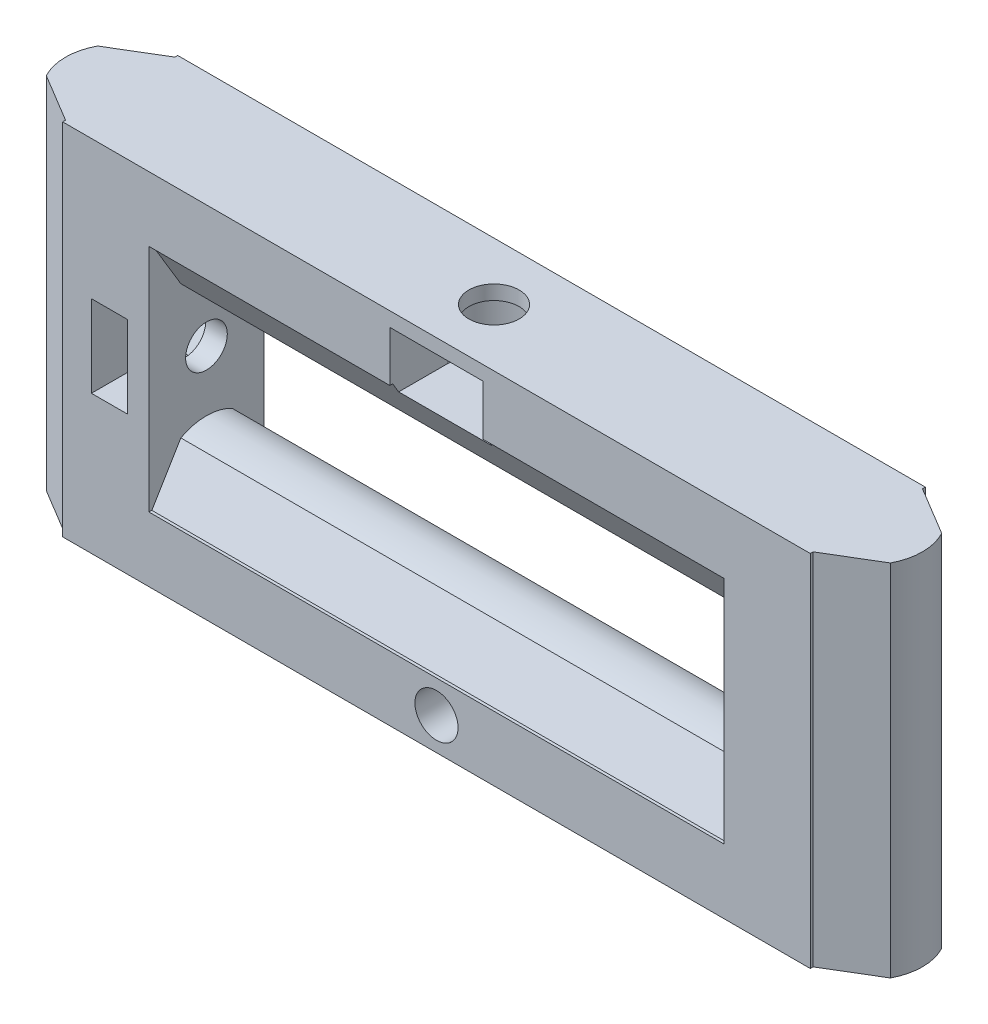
ISO-10303-21;
HEADER;
FILE_DESCRIPTION(('STEP AP214'),'2;1');
FILE_NAME('part.step','',(''),(''),'','','');
FILE_SCHEMA(('AUTOMOTIVE_DESIGN { 1 0 10303 214 1 1 1 1 }'));
ENDSEC;
DATA;
#1=APPLICATION_CONTEXT('core data for automotive mechanical design processes');
#2=APPLICATION_PROTOCOL_DEFINITION('international standard','automotive_design',2000,#1);
#3=PRODUCT_CONTEXT('',#1,'mechanical');
#4=PRODUCT('Part','Part','',(#3));
#5=PRODUCT_RELATED_PRODUCT_CATEGORY('part','',(#4));
#6=PRODUCT_DEFINITION_FORMATION('','',#4);
#7=PRODUCT_DEFINITION_CONTEXT('part definition',#1,'design');
#8=PRODUCT_DEFINITION('design','',#6,#7);
#9=PRODUCT_DEFINITION_SHAPE('','',#8);
#10=(LENGTH_UNIT() NAMED_UNIT(*) SI_UNIT(.MILLI.,.METRE.));
#11=(NAMED_UNIT(*) PLANE_ANGLE_UNIT() SI_UNIT($,.RADIAN.));
#12=(NAMED_UNIT(*) SI_UNIT($,.STERADIAN.) SOLID_ANGLE_UNIT());
#13=UNCERTAINTY_MEASURE_WITH_UNIT(LENGTH_MEASURE(1.E-05),#10,'distance_accuracy_value','');
#14=(GEOMETRIC_REPRESENTATION_CONTEXT(3) GLOBAL_UNCERTAINTY_ASSIGNED_CONTEXT((#13)) GLOBAL_UNIT_ASSIGNED_CONTEXT((#10,
#11,#12)) REPRESENTATION_CONTEXT('',''));
#15=CARTESIAN_POINT('',(0.,0.,0.));
#16=DIRECTION('',(0.,0.,1.));
#17=DIRECTION('',(1.,0.,0.));
#18=AXIS2_PLACEMENT_3D('',#15,#16,#17);
#19=CARTESIAN_POINT('',(-20.,20.5,0.));
#20=DIRECTION('',(0.,1.,0.));
#21=DIRECTION('',(0.,0.,1.));
#22=AXIS2_PLACEMENT_3D('',#19,#20,#21);
#23=PLANE('',#22);
#24=DIRECTION('',(0.,0.,-1.));
#25=VECTOR('',#24,1.);
#26=CARTESIAN_POINT('',(-3.25,20.5,0.));
#27=LINE('',#26,#25);
#28=CARTESIAN_POINT('',(-3.25,20.5,4.));
#29=VERTEX_POINT('',#28);
#30=CARTESIAN_POINT('',(-3.25,20.5,3.79999999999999));
#31=VERTEX_POINT('',#30);
#32=EDGE_CURVE('E315',#29,#31,#27,.T.);
#33=ORIENTED_EDGE('',*,*,#32,.F.);
#34=DIRECTION('',(1.,0.,0.));
#35=VECTOR('',#34,1.);
#36=CARTESIAN_POINT('',(0.,20.5,4.));
#37=LINE('',#36,#35);
#38=CARTESIAN_POINT('',(-20.,20.5,4.));
#39=VERTEX_POINT('',#38);
#40=EDGE_CURVE('E509',#39,#29,#37,.T.);
#41=ORIENTED_EDGE('',*,*,#40,.F.);
#42=DIRECTION('',(0.,0.,1.));
#43=VECTOR('',#42,1.);
#44=CARTESIAN_POINT('',(-20.,20.5,0.));
#45=LINE('',#44,#43);
#46=CARTESIAN_POINT('',(-20.,20.5,3.79999999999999));
#47=VERTEX_POINT('',#46);
#48=EDGE_CURVE('E1210',#47,#39,#45,.T.);
#49=ORIENTED_EDGE('',*,*,#48,.F.);
#50=DIRECTION('',(1.,0.,0.));
#51=VECTOR('',#50,1.);
#52=CARTESIAN_POINT('',(-20.,20.5,3.79999999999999));
#53=LINE('',#52,#51);
#54=EDGE_CURVE('E511',#47,#31,#53,.T.);
#55=ORIENTED_EDGE('',*,*,#54,.T.);
#56=EDGE_LOOP('',(#33,#41,#49,#55));
#57=FACE_BOUND('',#56,.T.);
#58=ADVANCED_FACE('F42',(#57),#23,.F.);
#59=CARTESIAN_POINT('',(0.,0.,4.));
#60=DIRECTION('',(0.,0.,-1.));
#61=DIRECTION('',(-1.,0.,0.));
#62=AXIS2_PLACEMENT_3D('',#59,#60,#61);
#63=PLANE('',#62);
#64=CARTESIAN_POINT('',(0.,2.25,4.));
#65=DIRECTION('',(0.,0.,1.));
#66=DIRECTION('',(1.,0.,0.));
#67=AXIS2_PLACEMENT_3D('',#64,#65,#66);
#68=CIRCLE('',#67,1.5);
#69=CARTESIAN_POINT('',(1.5,2.25,4.));
#70=VERTEX_POINT('',#69);
#71=EDGE_CURVE('E1197',#70,#70,#68,.T.);
#72=ORIENTED_EDGE('',*,*,#71,.F.);
#73=EDGE_LOOP('',(#72));
#74=FACE_BOUND('',#73,.T.);
#75=DIRECTION('',(1.,0.,0.));
#76=VECTOR('',#75,1.);
#77=CARTESIAN_POINT('',(0.,24.,4.));
#78=LINE('',#77,#76);
#79=CARTESIAN_POINT('',(-3.25,24.,4.));
#80=VERTEX_POINT('',#79);
#81=CARTESIAN_POINT('',(3.25,24.,4.));
#82=VERTEX_POINT('',#81);
#83=EDGE_CURVE('E296',#80,#82,#78,.T.);
#84=ORIENTED_EDGE('',*,*,#83,.T.);
#85=DIRECTION('',(0.,1.,0.));
#86=VECTOR('',#85,1.);
#87=CARTESIAN_POINT('',(3.25,19.8,4.));
#88=LINE('',#87,#86);
#89=CARTESIAN_POINT('',(3.25,20.5,4.));
#90=VERTEX_POINT('',#89);
#91=EDGE_CURVE('E316',#90,#82,#88,.T.);
#92=ORIENTED_EDGE('',*,*,#91,.F.);
#93=CARTESIAN_POINT('',(20.,20.5,4.));
#94=VERTEX_POINT('',#93);
#95=EDGE_CURVE('E519',#90,#94,#37,.T.);
#96=ORIENTED_EDGE('',*,*,#95,.T.);
#97=DIRECTION('',(0.,-1.,0.));
#98=VECTOR('',#97,1.);
#99=CARTESIAN_POINT('',(20.,0.,4.));
#100=LINE('',#99,#98);
#101=CARTESIAN_POINT('',(20.,4.5,4.));
#102=VERTEX_POINT('',#101);
#103=EDGE_CURVE('E593',#94,#102,#100,.T.);
#104=ORIENTED_EDGE('',*,*,#103,.T.);
#105=DIRECTION('',(1.,0.,0.));
#106=VECTOR('',#105,1.);
#107=CARTESIAN_POINT('',(0.,4.5,4.));
#108=LINE('',#107,#106);
#109=CARTESIAN_POINT('',(-20.,4.5,4.));
#110=VERTEX_POINT('',#109);
#111=EDGE_CURVE('E518',#110,#102,#108,.T.);
#112=ORIENTED_EDGE('',*,*,#111,.F.);
#113=DIRECTION('',(0.,-1.,0.));
#114=VECTOR('',#113,1.);
#115=CARTESIAN_POINT('',(-20.,0.,4.));
#116=LINE('',#115,#114);
#117=EDGE_CURVE('E516',#39,#110,#116,.T.);
#118=ORIENTED_EDGE('',*,*,#117,.F.);
#119=ORIENTED_EDGE('',*,*,#40,.T.);
#120=DIRECTION('',(0.,1.,0.));
#121=VECTOR('',#120,1.);
#122=CARTESIAN_POINT('',(-3.25,19.8,4.));
#123=LINE('',#122,#121);
#124=EDGE_CURVE('E286',#29,#80,#123,.T.);
#125=ORIENTED_EDGE('',*,*,#124,.T.);
#126=EDGE_LOOP('',(#84,#92,#96,#104,#112,#118,#119,#125));
#127=FACE_BOUND('',#126,.T.);
#128=DIRECTION('',(0.,-1.,0.));
#129=VECTOR('',#128,1.);
#130=CARTESIAN_POINT('',(-26.,25.,4.));
#131=LINE('',#130,#129);
#132=CARTESIAN_POINT('',(-26.,25.,4.));
#133=VERTEX_POINT('',#132);
#134=CARTESIAN_POINT('',(-26.,0.,4.));
#135=VERTEX_POINT('',#134);
#136=EDGE_CURVE('E619',#133,#135,#131,.T.);
#137=ORIENTED_EDGE('',*,*,#136,.T.);
#138=DIRECTION('',(1.,0.,0.));
#139=VECTOR('',#138,1.);
#140=CARTESIAN_POINT('',(26.,0.,4.));
#141=LINE('',#140,#139);
#142=CARTESIAN_POINT('',(26.,0.,4.));
#143=VERTEX_POINT('',#142);
#144=EDGE_CURVE('E623',#135,#143,#141,.T.);
#145=ORIENTED_EDGE('',*,*,#144,.T.);
#146=DIRECTION('',(0.,1.,0.));
#147=VECTOR('',#146,1.);
#148=CARTESIAN_POINT('',(26.,25.,4.));
#149=LINE('',#148,#147);
#150=CARTESIAN_POINT('',(26.,25.,4.));
#151=VERTEX_POINT('',#150);
#152=EDGE_CURVE('E627',#143,#151,#149,.T.);
#153=ORIENTED_EDGE('',*,*,#152,.T.);
#154=DIRECTION('',(-1.,0.,0.));
#155=VECTOR('',#154,1.);
#156=CARTESIAN_POINT('',(26.,25.,4.));
#157=LINE('',#156,#155);
#158=EDGE_CURVE('E630',#151,#133,#157,.T.);
#159=ORIENTED_EDGE('',*,*,#158,.T.);
#160=EDGE_LOOP('',(#137,#145,#153,#159));
#161=FACE_BOUND('',#160,.T.);
#162=DIRECTION('',(0.,1.,0.));
#163=VECTOR('',#162,1.);
#164=CARTESIAN_POINT('',(-21.5,0.,4.));
#165=LINE('',#164,#163);
#166=CARTESIAN_POINT('',(-21.5,9.65,4.));
#167=VERTEX_POINT('',#166);
#168=CARTESIAN_POINT('',(-21.5,15.35,4.));
#169=VERTEX_POINT('',#168);
#170=EDGE_CURVE('E338',#167,#169,#165,.T.);
#171=ORIENTED_EDGE('',*,*,#170,.F.);
#172=DIRECTION('',(-1.,0.,0.));
#173=VECTOR('',#172,1.);
#174=CARTESIAN_POINT('',(-21.5,9.65,4.));
#175=LINE('',#174,#173);
#176=CARTESIAN_POINT('',(-24.,9.65,4.));
#177=VERTEX_POINT('',#176);
#178=EDGE_CURVE('E354',#167,#177,#175,.T.);
#179=ORIENTED_EDGE('',*,*,#178,.T.);
#180=DIRECTION('',(0.,1.,0.));
#181=VECTOR('',#180,1.);
#182=CARTESIAN_POINT('',(-24.,0.,4.));
#183=LINE('',#182,#181);
#184=CARTESIAN_POINT('',(-24.,15.35,4.));
#185=VERTEX_POINT('',#184);
#186=EDGE_CURVE('E362',#177,#185,#183,.T.);
#187=ORIENTED_EDGE('',*,*,#186,.T.);
#188=DIRECTION('',(-1.,0.,0.));
#189=VECTOR('',#188,1.);
#190=CARTESIAN_POINT('',(-21.5,15.35,4.));
#191=LINE('',#190,#189);
#192=EDGE_CURVE('E385',#169,#185,#191,.T.);
#193=ORIENTED_EDGE('',*,*,#192,.F.);
#194=EDGE_LOOP('',(#171,#179,#187,#193));
#195=FACE_BOUND('',#194,.T.);
#196=ADVANCED_FACE('F468',(#74,#127,#161,#195),#63,.F.);
#197=CARTESIAN_POINT('',(-29.8,12.5,0.));
#198=DIRECTION('',(1.,0.,0.));
#199=DIRECTION('',(0.,0.,-1.));
#200=AXIS2_PLACEMENT_3D('',#197,#198,#199);
#201=CYLINDRICAL_SURFACE('',#200,1.45);
#202=CARTESIAN_POINT('',(-20.,12.5,0.));
#203=DIRECTION('',(1.,0.,0.));
#204=DIRECTION('',(0.,0.,-1.));
#205=AXIS2_PLACEMENT_3D('',#202,#203,#204);
#206=CIRCLE('',#205,1.45);
#207=CARTESIAN_POINT('',(-20.,12.5,-1.45));
#208=VERTEX_POINT('',#207);
#209=EDGE_CURVE('E378',#208,#208,#206,.T.);
#210=ORIENTED_EDGE('',*,*,#209,.T.);
#211=EDGE_LOOP('',(#210));
#212=FACE_BOUND('',#211,.T.);
#213=CARTESIAN_POINT('',(-21.5,12.5,0.));
#214=DIRECTION('',(-1.,0.,0.));
#215=DIRECTION('',(0.,0.,1.));
#216=AXIS2_PLACEMENT_3D('',#213,#214,#215);
#217=CIRCLE('',#216,1.45);
#218=CARTESIAN_POINT('',(-21.5,12.5,1.45));
#219=VERTEX_POINT('',#218);
#220=EDGE_CURVE('E329',#219,#219,#217,.T.);
#221=ORIENTED_EDGE('',*,*,#220,.T.);
#222=EDGE_LOOP('',(#221));
#223=FACE_BOUND('',#222,.T.);
#224=ADVANCED_FACE('F418',(#212,#223),#201,.F.);
#225=CARTESIAN_POINT('',(0.,0.,-4.));
#226=DIRECTION('',(0.,0.,-1.));
#227=DIRECTION('',(-1.,0.,0.));
#228=AXIS2_PLACEMENT_3D('',#225,#226,#227);
#229=PLANE('',#228);
#230=CARTESIAN_POINT('',(0.,2.25,-4.));
#231=DIRECTION('',(0.,0.,1.));
#232=DIRECTION('',(1.,0.,0.));
#233=AXIS2_PLACEMENT_3D('',#230,#231,#232);
#234=CIRCLE('',#233,1.5);
#235=CARTESIAN_POINT('',(1.5,2.25,-4.));
#236=VERTEX_POINT('',#235);
#237=EDGE_CURVE('E1194',#236,#236,#234,.T.);
#238=ORIENTED_EDGE('',*,*,#237,.T.);
#239=EDGE_LOOP('',(#238));
#240=FACE_BOUND('',#239,.T.);
#241=DIRECTION('',(0.,-1.,0.));
#242=VECTOR('',#241,1.);
#243=CARTESIAN_POINT('',(-26.,25.,-4.));
#244=LINE('',#243,#242);
#245=CARTESIAN_POINT('',(-26.,25.,-4.));
#246=VERTEX_POINT('',#245);
#247=CARTESIAN_POINT('',(-26.,0.,-4.));
#248=VERTEX_POINT('',#247);
#249=EDGE_CURVE('E618',#246,#248,#244,.T.);
#250=ORIENTED_EDGE('',*,*,#249,.F.);
#251=DIRECTION('',(-1.,0.,0.));
#252=VECTOR('',#251,1.);
#253=CARTESIAN_POINT('',(26.,25.,-4.));
#254=LINE('',#253,#252);
#255=CARTESIAN_POINT('',(26.,25.,-4.));
#256=VERTEX_POINT('',#255);
#257=EDGE_CURVE('E624',#256,#246,#254,.T.);
#258=ORIENTED_EDGE('',*,*,#257,.F.);
#259=DIRECTION('',(0.,1.,0.));
#260=VECTOR('',#259,1.);
#261=CARTESIAN_POINT('',(26.,25.,-4.));
#262=LINE('',#261,#260);
#263=CARTESIAN_POINT('',(26.,0.,-4.));
#264=VERTEX_POINT('',#263);
#265=EDGE_CURVE('E641',#264,#256,#262,.T.);
#266=ORIENTED_EDGE('',*,*,#265,.F.);
#267=DIRECTION('',(1.,0.,0.));
#268=VECTOR('',#267,1.);
#269=CARTESIAN_POINT('',(26.,0.,-4.));
#270=LINE('',#269,#268);
#271=EDGE_CURVE('E637',#248,#264,#270,.T.);
#272=ORIENTED_EDGE('',*,*,#271,.F.);
#273=EDGE_LOOP('',(#250,#258,#266,#272));
#274=FACE_BOUND('',#273,.T.);
#275=DIRECTION('',(-1.,0.,0.));
#276=VECTOR('',#275,1.);
#277=CARTESIAN_POINT('',(0.,20.5,-4.));
#278=LINE('',#277,#276);
#279=CARTESIAN_POINT('',(20.,20.5,-4.));
#280=VERTEX_POINT('',#279);
#281=CARTESIAN_POINT('',(-20.,20.5,-4.));
#282=VERTEX_POINT('',#281);
#283=EDGE_CURVE('E741',#280,#282,#278,.T.);
#284=ORIENTED_EDGE('',*,*,#283,.T.);
#285=DIRECTION('',(0.,-1.,0.));
#286=VECTOR('',#285,1.);
#287=CARTESIAN_POINT('',(-20.,0.,-4.));
#288=LINE('',#287,#286);
#289=CARTESIAN_POINT('',(-20.,4.5,-4.));
#290=VERTEX_POINT('',#289);
#291=EDGE_CURVE('E526',#282,#290,#288,.T.);
#292=ORIENTED_EDGE('',*,*,#291,.T.);
#293=DIRECTION('',(-1.,0.,0.));
#294=VECTOR('',#293,1.);
#295=CARTESIAN_POINT('',(0.,4.5,-4.));
#296=LINE('',#295,#294);
#297=CARTESIAN_POINT('',(20.,4.5,-4.));
#298=VERTEX_POINT('',#297);
#299=EDGE_CURVE('E739',#298,#290,#296,.T.);
#300=ORIENTED_EDGE('',*,*,#299,.F.);
#301=DIRECTION('',(0.,-1.,0.));
#302=VECTOR('',#301,1.);
#303=CARTESIAN_POINT('',(20.,0.,-4.));
#304=LINE('',#303,#302);
#305=EDGE_CURVE('E736',#280,#298,#304,.T.);
#306=ORIENTED_EDGE('',*,*,#305,.F.);
#307=EDGE_LOOP('',(#284,#292,#300,#306));
#308=FACE_BOUND('',#307,.T.);
#309=ADVANCED_FACE('F472',(#240,#274,#308),#229,.T.);
#310=CARTESIAN_POINT('',(8.57447011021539,25.,14.2703146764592));
#311=DIRECTION('',(-0.515038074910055,0.,-0.857167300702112));
#312=DIRECTION('',(-0.857167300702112,0.,0.515038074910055));
#313=AXIS2_PLACEMENT_3D('',#310,#311,#312);
#314=PLANE('',#313);
#315=DIRECTION('',(0.857167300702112,0.,-0.515038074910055));
#316=VECTOR('',#315,1.);
#317=CARTESIAN_POINT('',(8.57447011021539,0.,14.2703146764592));
#318=LINE('',#317,#316);
#319=CARTESIAN_POINT('',(26.,0.,3.8));
#320=VERTEX_POINT('',#319);
#321=CARTESIAN_POINT('',(29.3552008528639,0.,1.78399193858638));
#322=VERTEX_POINT('',#321);
#323=EDGE_CURVE('E664',#320,#322,#318,.T.);
#324=ORIENTED_EDGE('',*,*,#323,.T.);
#325=DIRECTION('',(0.,-1.,0.));
#326=VECTOR('',#325,1.);
#327=CARTESIAN_POINT('',(29.3552008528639,25.,1.78399193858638));
#328=LINE('',#327,#326);
#329=CARTESIAN_POINT('',(29.3552008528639,25.,1.78399193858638));
#330=VERTEX_POINT('',#329);
#331=EDGE_CURVE('E732',#330,#322,#328,.T.);
#332=ORIENTED_EDGE('',*,*,#331,.F.);
#333=DIRECTION('',(0.857167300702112,0.,-0.515038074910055));
#334=VECTOR('',#333,1.);
#335=CARTESIAN_POINT('',(8.57447011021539,25.,14.2703146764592));
#336=LINE('',#335,#334);
#337=CARTESIAN_POINT('',(26.,25.,3.79999999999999));
#338=VERTEX_POINT('',#337);
#339=EDGE_CURVE('E665',#338,#330,#336,.T.);
#340=ORIENTED_EDGE('',*,*,#339,.F.);
#341=DIRECTION('',(0.,-1.,0.));
#342=VECTOR('',#341,1.);
#343=CARTESIAN_POINT('',(26.,25.,3.79999999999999));
#344=LINE('',#343,#342);
#345=EDGE_CURVE('E687',#338,#320,#344,.T.);
#346=ORIENTED_EDGE('',*,*,#345,.T.);
#347=EDGE_LOOP('',(#324,#332,#340,#346));
#348=FACE_BOUND('',#347,.T.);
#349=ADVANCED_FACE('F44',(#348),#314,.F.);
#350=CARTESIAN_POINT('',(26.,25.,0.));
#351=DIRECTION('',(0.,-1.,0.));
#352=DIRECTION('',(0.,0.,-1.));
#353=AXIS2_PLACEMENT_3D('',#350,#351,#352);
#354=CYLINDRICAL_SURFACE('',#353,3.8);
#355=CARTESIAN_POINT('',(26.,0.,0.));
#356=DIRECTION('',(0.,1.,0.));
#357=DIRECTION('',(0.,0.,1.));
#358=AXIS2_PLACEMENT_3D('',#355,#356,#357);
#359=CIRCLE('',#358,3.8);
#360=CARTESIAN_POINT('',(29.3552008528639,0.,-1.78399193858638));
#361=VERTEX_POINT('',#360);
#362=EDGE_CURVE('E691',#322,#361,#359,.T.);
#363=ORIENTED_EDGE('',*,*,#362,.T.);
#364=DIRECTION('',(0.,-1.,0.));
#365=VECTOR('',#364,1.);
#366=CARTESIAN_POINT('',(29.3552008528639,25.,-1.78399193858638));
#367=LINE('',#366,#365);
#368=CARTESIAN_POINT('',(29.3552008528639,25.,-1.78399193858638));
#369=VERTEX_POINT('',#368);
#370=EDGE_CURVE('E729',#369,#361,#367,.T.);
#371=ORIENTED_EDGE('',*,*,#370,.F.);
#372=CARTESIAN_POINT('',(26.,25.,0.));
#373=DIRECTION('',(0.,1.,0.));
#374=DIRECTION('',(0.,0.,1.));
#375=AXIS2_PLACEMENT_3D('',#372,#373,#374);
#376=CIRCLE('',#375,3.8);
#377=EDGE_CURVE('E669',#330,#369,#376,.T.);
#378=ORIENTED_EDGE('',*,*,#377,.F.);
#379=ORIENTED_EDGE('',*,*,#331,.T.);
#380=EDGE_LOOP('',(#363,#371,#378,#379));
#381=FACE_BOUND('',#380,.T.);
#382=ADVANCED_FACE('F798',(#381),#354,.T.);
#383=CARTESIAN_POINT('',(8.57447011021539,25.,-14.2703146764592));
#384=DIRECTION('',(0.515038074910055,0.,-0.857167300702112));
#385=DIRECTION('',(-0.857167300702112,0.,-0.515038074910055));
#386=AXIS2_PLACEMENT_3D('',#383,#384,#385);
#387=PLANE('',#386);
#388=DIRECTION('',(0.857167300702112,0.,0.515038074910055));
#389=VECTOR('',#388,1.);
#390=CARTESIAN_POINT('',(8.57447011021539,0.,-14.2703146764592));
#391=LINE('',#390,#389);
#392=CARTESIAN_POINT('',(26.,0.,-3.80000000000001));
#393=VERTEX_POINT('',#392);
#394=EDGE_CURVE('E695',#393,#361,#391,.T.);
#395=ORIENTED_EDGE('',*,*,#394,.F.);
#396=DIRECTION('',(0.,-1.,0.));
#397=VECTOR('',#396,1.);
#398=CARTESIAN_POINT('',(26.,25.,-3.80000000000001));
#399=LINE('',#398,#397);
#400=CARTESIAN_POINT('',(26.,25.,-3.80000000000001));
#401=VERTEX_POINT('',#400);
#402=EDGE_CURVE('E726',#401,#393,#399,.T.);
#403=ORIENTED_EDGE('',*,*,#402,.F.);
#404=DIRECTION('',(0.857167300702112,0.,0.515038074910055));
#405=VECTOR('',#404,1.);
#406=CARTESIAN_POINT('',(8.57447011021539,25.,-14.2703146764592));
#407=LINE('',#406,#405);
#408=EDGE_CURVE('E673',#401,#369,#407,.T.);
#409=ORIENTED_EDGE('',*,*,#408,.T.);
#410=ORIENTED_EDGE('',*,*,#370,.T.);
#411=EDGE_LOOP('',(#395,#403,#409,#410));
#412=FACE_BOUND('',#411,.T.);
#413=ADVANCED_FACE('F795',(#412),#387,.T.);
#414=CARTESIAN_POINT('',(-8.57447011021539,25.,-14.2703146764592));
#415=DIRECTION('',(0.515038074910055,0.,0.857167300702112));
#416=DIRECTION('',(0.857167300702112,0.,-0.515038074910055));
#417=AXIS2_PLACEMENT_3D('',#414,#415,#416);
#418=PLANE('',#417);
#419=DIRECTION('',(-0.857167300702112,0.,0.515038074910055));
#420=VECTOR('',#419,1.);
#421=CARTESIAN_POINT('',(-8.57447011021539,0.,-14.2703146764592));
#422=LINE('',#421,#420);
#423=CARTESIAN_POINT('',(-26.,0.,-3.8));
#424=VERTEX_POINT('',#423);
#425=CARTESIAN_POINT('',(-29.3552008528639,0.,-1.78399193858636));
#426=VERTEX_POINT('',#425);
#427=EDGE_CURVE('E699',#424,#426,#422,.T.);
#428=ORIENTED_EDGE('',*,*,#427,.T.);
#429=DIRECTION('',(0.,-1.,0.));
#430=VECTOR('',#429,1.);
#431=CARTESIAN_POINT('',(-29.3552008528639,25.,-1.78399193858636));
#432=LINE('',#431,#430);
#433=CARTESIAN_POINT('',(-29.3552008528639,25.,-1.78399193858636));
#434=VERTEX_POINT('',#433);
#435=EDGE_CURVE('E718',#434,#426,#432,.T.);
#436=ORIENTED_EDGE('',*,*,#435,.F.);
#437=DIRECTION('',(-0.857167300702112,0.,0.515038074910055));
#438=VECTOR('',#437,1.);
#439=CARTESIAN_POINT('',(-8.57447011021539,25.,-14.2703146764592));
#440=LINE('',#439,#438);
#441=CARTESIAN_POINT('',(-26.,25.,-3.80000000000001));
#442=VERTEX_POINT('',#441);
#443=EDGE_CURVE('E677',#442,#434,#440,.T.);
#444=ORIENTED_EDGE('',*,*,#443,.F.);
#445=DIRECTION('',(0.,-1.,0.));
#446=VECTOR('',#445,1.);
#447=CARTESIAN_POINT('',(-26.,25.,-3.8));
#448=LINE('',#447,#446);
#449=EDGE_CURVE('E722',#442,#424,#448,.T.);
#450=ORIENTED_EDGE('',*,*,#449,.T.);
#451=EDGE_LOOP('',(#428,#436,#444,#450));
#452=FACE_BOUND('',#451,.T.);
#453=ADVANCED_FACE('F498',(#452),#418,.F.);
#454=CARTESIAN_POINT('',(-26.,25.,0.));
#455=DIRECTION('',(0.,-1.,0.));
#456=DIRECTION('',(0.,0.,-1.));
#457=AXIS2_PLACEMENT_3D('',#454,#455,#456);
#458=CYLINDRICAL_SURFACE('',#457,3.8);
#459=CARTESIAN_POINT('',(-29.8,11.05,0.));
#460=CARTESIAN_POINT('',(-29.8000024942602,11.0499967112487,-0.0784288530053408));
#461=CARTESIAN_POINT('',(-29.7975510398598,11.0563829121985,-0.156835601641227));
#462=CARTESIAN_POINT('',(-29.7880173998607,11.0816512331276,-0.311300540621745));
#463=CARTESIAN_POINT('',(-29.7809360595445,11.1005310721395,-0.387359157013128));
#464=CARTESIAN_POINT('',(-29.7629011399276,11.150018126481,-0.534877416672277));
#465=CARTESIAN_POINT('',(-29.7519551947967,11.1806022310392,-0.606345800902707));
#466=CARTESIAN_POINT('',(-29.7272769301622,11.2525099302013,-0.743130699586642));
#467=CARTESIAN_POINT('',(-29.7135438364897,11.2938365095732,-0.808445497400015));
#468=CARTESIAN_POINT('',(-29.6840332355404,11.3879423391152,-0.933926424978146));
#469=CARTESIAN_POINT('',(-29.668196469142,11.4411089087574,-0.993788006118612));
#470=CARTESIAN_POINT('',(-29.6365497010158,11.5565632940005,-1.103992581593));
#471=CARTESIAN_POINT('',(-29.6207397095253,11.6188540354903,-1.15433251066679));
#472=CARTESIAN_POINT('',(-29.5902404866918,11.7538041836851,-1.24603591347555));
#473=CARTESIAN_POINT('',(-29.5756207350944,11.8267772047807,-1.28696331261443));
#474=CARTESIAN_POINT('',(-29.5500829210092,11.9792158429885,-1.35582828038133));
#475=CARTESIAN_POINT('',(-29.5391633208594,12.0586787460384,-1.38377124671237));
#476=CARTESIAN_POINT('',(-29.5228974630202,12.218331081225,-1.42466211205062));
#477=CARTESIAN_POINT('',(-29.5173355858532,12.2983485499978,-1.43819268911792));
#478=CARTESIAN_POINT('',(-29.5117854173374,12.459696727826,-1.45169622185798));
#479=CARTESIAN_POINT('',(-29.5117947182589,12.5410268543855,-1.45167503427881));
#480=CARTESIAN_POINT('',(-29.5172004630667,12.6972935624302,-1.43852012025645));
#481=CARTESIAN_POINT('',(-29.5222611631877,12.7723127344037,-1.42620360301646));
#482=CARTESIAN_POINT('',(-29.5366400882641,12.9191255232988,-1.39016163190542));
#483=CARTESIAN_POINT('',(-29.545958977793,12.9909186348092,-1.3664343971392));
#484=CARTESIAN_POINT('',(-29.5680005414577,13.1308755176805,-1.30780943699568));
#485=CARTESIAN_POINT('',(-29.5807855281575,13.198942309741,-1.27270465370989));
#486=CARTESIAN_POINT('',(-29.6082989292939,13.3284526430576,-1.1924656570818));
#487=CARTESIAN_POINT('',(-29.6230280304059,13.3898938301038,-1.147327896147));
#488=CARTESIAN_POINT('',(-29.6540233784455,13.5089196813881,-1.04459707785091));
#489=CARTESIAN_POINT('',(-29.6703251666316,13.5659360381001,-0.986354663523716));
#490=CARTESIAN_POINT('',(-29.7017480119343,13.669564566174,-0.86095068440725));
#491=CARTESIAN_POINT('',(-29.7168688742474,13.716175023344,-0.793787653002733));
#492=CARTESIAN_POINT('',(-29.7445460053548,13.7983254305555,-0.650957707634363));
#493=CARTESIAN_POINT('',(-29.7570557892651,13.8336698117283,-0.575168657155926));
#494=CARTESIAN_POINT('',(-29.7777548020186,13.8909165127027,-0.418123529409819));
#495=CARTESIAN_POINT('',(-29.7859460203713,13.9128250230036,-0.336869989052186));
#496=CARTESIAN_POINT('',(-29.7967319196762,13.9414709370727,-0.175980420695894));
#497=CARTESIAN_POINT('',(-29.7996084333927,13.9489732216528,-0.0964993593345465));
#498=CARTESIAN_POINT('',(-29.8003160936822,13.9508289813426,0.062629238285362));
#499=CARTESIAN_POINT('',(-29.798148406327,13.94518549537,0.142276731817));
#500=CARTESIAN_POINT('',(-29.7891968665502,13.9214865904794,0.296130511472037));
#501=CARTESIAN_POINT('',(-29.7826014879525,13.9039376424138,0.370426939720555));
#502=CARTESIAN_POINT('',(-29.7656487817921,13.8575985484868,0.514964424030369));
#503=CARTESIAN_POINT('',(-29.7552909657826,13.8288069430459,0.585204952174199));
#504=CARTESIAN_POINT('',(-29.731448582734,13.7598741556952,0.721981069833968));
#505=CARTESIAN_POINT('',(-29.7178801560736,13.7194207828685,0.788344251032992));
#506=CARTESIAN_POINT('',(-29.6891098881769,13.6286638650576,0.913565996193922));
#507=CARTESIAN_POINT('',(-29.6739074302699,13.5783565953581,0.972421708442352));
#508=CARTESIAN_POINT('',(-29.642404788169,13.4657652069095,1.08466053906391));
#509=CARTESIAN_POINT('',(-29.6260935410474,13.4029429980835,1.13750218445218));
#510=CARTESIAN_POINT('',(-29.595085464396,13.2690098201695,1.23200699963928));
#511=CARTESIAN_POINT('',(-29.5803888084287,13.1978979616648,1.27366896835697));
#512=CARTESIAN_POINT('',(-29.5543156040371,13.0487002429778,1.34472616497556));
#513=CARTESIAN_POINT('',(-29.5429576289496,12.9705784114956,1.37405314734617));
#514=CARTESIAN_POINT('',(-29.5252261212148,12.8099480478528,1.41893422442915));
#515=CARTESIAN_POINT('',(-29.5188493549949,12.7274423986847,1.43449725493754));
#516=CARTESIAN_POINT('',(-29.5122416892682,12.5662768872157,1.45059535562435));
#517=CARTESIAN_POINT('',(-29.5116315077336,12.4877245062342,1.45205798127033));
#518=CARTESIAN_POINT('',(-29.5156481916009,12.3315547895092,1.44230551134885));
#519=CARTESIAN_POINT('',(-29.5202745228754,12.2539373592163,1.43109170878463));
#520=CARTESIAN_POINT('',(-29.5339222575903,12.1044260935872,1.39703641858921));
#521=CARTESIAN_POINT('',(-29.5427948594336,12.0324280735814,1.37458750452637));
#522=CARTESIAN_POINT('',(-29.5638439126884,11.8931815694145,1.31905043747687));
#523=CARTESIAN_POINT('',(-29.5760212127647,11.8259343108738,1.28595955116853));
#524=CARTESIAN_POINT('',(-29.603121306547,11.6941672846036,1.20801654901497));
#525=CARTESIAN_POINT('',(-29.6181564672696,11.6299882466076,1.16262799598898));
#526=CARTESIAN_POINT('',(-29.6489032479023,11.5098620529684,1.06219628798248));
#527=CARTESIAN_POINT('',(-29.6646150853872,11.4539175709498,1.00715000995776));
#528=CARTESIAN_POINT('',(-29.6960174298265,11.3486022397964,0.885229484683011));
#529=CARTESIAN_POINT('',(-29.7116559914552,11.2997855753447,0.817860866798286));
#530=CARTESIAN_POINT('',(-29.7402160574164,11.2141739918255,0.675324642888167));
#531=CARTESIAN_POINT('',(-29.7531371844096,11.1773807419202,0.600155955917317));
#532=CARTESIAN_POINT('',(-29.7754199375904,11.1153741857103,0.439481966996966));
#533=CARTESIAN_POINT('',(-29.7845302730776,11.0909605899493,0.353629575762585));
#534=CARTESIAN_POINT('',(-29.7968172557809,11.0582798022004,0.178507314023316));
#535=CARTESIAN_POINT('',(-29.7999971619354,11.050003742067,0.0892393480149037));
#536=CARTESIAN_POINT('',(-29.8,11.05,0.));
#537=B_SPLINE_CURVE_WITH_KNOTS('',3,(#459,#460,#461,#462,#463,#464,#465,#466,#467,#468,#469,
#470,#471,#472,#473,#474,#475,#476,#477,#478,#479,#480,#481,#482,#483,#484,#485,#486,#487,#488,
#489,#490,#491,#492,#493,#494,#495,#496,#497,#498,#499,#500,#501,#502,#503,#504,#505,#506,#507,
#508,#509,#510,#511,#512,#513,#514,#515,#516,#517,#518,#519,#520,#521,#522,#523,#524,#525,#526,
#527,#528,#529,#530,#531,#532,#533,#534,#535,#536),.UNSPECIFIED.,.T.,.F.,(4,2,2,2,2,2,2,2,2,2,2,
2,2,2,2,2,2,2,2,2,2,2,2,2,2,2,2,2,2,2,2,2,2,2,2,2,2,2,4),(0.,0.23495729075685,0.469871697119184,
0.704324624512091,0.938842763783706,1.18260772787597,1.42645103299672,1.67998185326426,
1.93340718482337,2.17614502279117,2.41877795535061,2.64629086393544,2.87383929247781,
3.10578618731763,3.33781522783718,3.58603575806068,3.83429714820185,4.08665910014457,
4.33890469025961,4.57734112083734,4.81572243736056,5.04455063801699,5.27340855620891,
5.50907555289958,5.74483180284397,5.99475667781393,6.24470839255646,6.49602537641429,
6.74717908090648,6.9816888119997,7.21617462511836,7.44298597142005,7.66985561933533,
7.90891599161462,8.14805381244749,8.40078043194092,8.65354212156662,8.92103254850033,
9.18837593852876),.UNSPECIFIED.);
#538=CARTESIAN_POINT('',(-29.8,11.05,0.));
#539=VERTEX_POINT('',#538);
#540=EDGE_CURVE('E394',#539,#539,#537,.T.);
#541=ORIENTED_EDGE('',*,*,#540,.T.);
#542=EDGE_LOOP('',(#541));
#543=FACE_BOUND('',#542,.T.);
#544=CARTESIAN_POINT('',(-26.,0.,0.));
#545=DIRECTION('',(0.,1.,0.));
#546=DIRECTION('',(0.,0.,1.));
#547=AXIS2_PLACEMENT_3D('',#544,#545,#546);
#548=CIRCLE('',#547,3.8);
#549=CARTESIAN_POINT('',(-29.3552008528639,0.,1.78399193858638));
#550=VERTEX_POINT('',#549);
#551=EDGE_CURVE('E702',#426,#550,#548,.T.);
#552=ORIENTED_EDGE('',*,*,#551,.T.);
#553=DIRECTION('',(0.,-1.,0.));
#554=VECTOR('',#553,1.);
#555=CARTESIAN_POINT('',(-29.3552008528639,25.,1.78399193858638));
#556=LINE('',#555,#554);
#557=CARTESIAN_POINT('',(-29.3552008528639,25.,1.78399193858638));
#558=VERTEX_POINT('',#557);
#559=EDGE_CURVE('E715',#558,#550,#556,.T.);
#560=ORIENTED_EDGE('',*,*,#559,.F.);
#561=CARTESIAN_POINT('',(-26.,25.,0.));
#562=DIRECTION('',(0.,1.,0.));
#563=DIRECTION('',(0.,0.,1.));
#564=AXIS2_PLACEMENT_3D('',#561,#562,#563);
#565=CIRCLE('',#564,3.8);
#566=EDGE_CURVE('E680',#434,#558,#565,.T.);
#567=ORIENTED_EDGE('',*,*,#566,.F.);
#568=ORIENTED_EDGE('',*,*,#435,.T.);
#569=EDGE_LOOP('',(#552,#560,#567,#568));
#570=FACE_BOUND('',#569,.T.);
#571=ADVANCED_FACE('F406',(#543,#570),#458,.T.);
#572=CARTESIAN_POINT('',(-8.57447011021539,25.,14.2703146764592));
#573=DIRECTION('',(-0.515038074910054,0.,0.857167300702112));
#574=DIRECTION('',(0.857167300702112,0.,0.515038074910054));
#575=AXIS2_PLACEMENT_3D('',#572,#573,#574);
#576=PLANE('',#575);
#577=DIRECTION('',(-0.857167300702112,0.,-0.515038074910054));
#578=VECTOR('',#577,1.);
#579=CARTESIAN_POINT('',(-8.57447011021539,0.,14.2703146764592));
#580=LINE('',#579,#578);
#581=CARTESIAN_POINT('',(-26.,0.,3.8));
#582=VERTEX_POINT('',#581);
#583=EDGE_CURVE('E670',#582,#550,#580,.T.);
#584=ORIENTED_EDGE('',*,*,#583,.F.);
#585=DIRECTION('',(0.,-1.,0.));
#586=VECTOR('',#585,1.);
#587=CARTESIAN_POINT('',(-26.,25.,3.8));
#588=LINE('',#587,#586);
#589=CARTESIAN_POINT('',(-26.,25.,3.8));
#590=VERTEX_POINT('',#589);
#591=EDGE_CURVE('E712',#590,#582,#588,.T.);
#592=ORIENTED_EDGE('',*,*,#591,.F.);
#593=DIRECTION('',(-0.857167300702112,0.,-0.515038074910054));
#594=VECTOR('',#593,1.);
#595=CARTESIAN_POINT('',(-8.57447011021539,25.,14.2703146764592));
#596=LINE('',#595,#594);
#597=EDGE_CURVE('E683',#590,#558,#596,.T.);
#598=ORIENTED_EDGE('',*,*,#597,.T.);
#599=ORIENTED_EDGE('',*,*,#559,.T.);
#600=EDGE_LOOP('',(#584,#592,#598,#599));
#601=FACE_BOUND('',#600,.T.);
#602=ADVANCED_FACE('F489',(#601),#576,.T.);
#603=CARTESIAN_POINT('',(0.,25.,0.));
#604=DIRECTION('',(0.,1.,0.));
#605=DIRECTION('',(0.,0.,1.));
#606=AXIS2_PLACEMENT_3D('',#603,#604,#605);
#607=PLANE('',#606);
#608=CARTESIAN_POINT('',(0.,25.,0.));
#609=DIRECTION('',(0.,1.,0.));
#610=DIRECTION('',(0.,0.,1.));
#611=AXIS2_PLACEMENT_3D('',#608,#609,#610);
#612=CIRCLE('',#611,1.75);
#613=CARTESIAN_POINT('',(0.,25.,1.75));
#614=VERTEX_POINT('',#613);
#615=EDGE_CURVE('E299',#614,#614,#612,.T.);
#616=ORIENTED_EDGE('',*,*,#615,.F.);
#617=EDGE_LOOP('',(#616));
#618=FACE_BOUND('',#617,.T.);
#619=ORIENTED_EDGE('',*,*,#408,.F.);
#620=DIRECTION('',(0.,0.,-1.));
#621=VECTOR('',#620,1.);
#622=CARTESIAN_POINT('',(26.,25.,4.));
#623=LINE('',#622,#621);
#624=EDGE_CURVE('E651',#401,#256,#623,.T.);
#625=ORIENTED_EDGE('',*,*,#624,.T.);
#626=ORIENTED_EDGE('',*,*,#257,.T.);
#627=DIRECTION('',(0.,0.,-1.));
#628=VECTOR('',#627,1.);
#629=CARTESIAN_POINT('',(-26.,25.,4.));
#630=LINE('',#629,#628);
#631=EDGE_CURVE('E633',#442,#246,#630,.T.);
#632=ORIENTED_EDGE('',*,*,#631,.F.);
#633=ORIENTED_EDGE('',*,*,#443,.T.);
#634=ORIENTED_EDGE('',*,*,#566,.T.);
#635=ORIENTED_EDGE('',*,*,#597,.F.);
#636=EDGE_CURVE('E648',#133,#590,#630,.T.);
#637=ORIENTED_EDGE('',*,*,#636,.F.);
#638=ORIENTED_EDGE('',*,*,#158,.F.);
#639=EDGE_CURVE('E652',#151,#338,#623,.T.);
#640=ORIENTED_EDGE('',*,*,#639,.T.);
#641=ORIENTED_EDGE('',*,*,#339,.T.);
#642=ORIENTED_EDGE('',*,*,#377,.T.);
#643=EDGE_LOOP('',(#619,#625,#626,#632,#633,#634,#635,#637,#638,#640,#641,#642));
#644=FACE_BOUND('',#643,.T.);
#645=ADVANCED_FACE('F485',(#618,#644),#607,.T.);
#646=CARTESIAN_POINT('',(0.,0.,0.));
#647=DIRECTION('',(0.,1.,0.));
#648=DIRECTION('',(0.,0.,1.));
#649=AXIS2_PLACEMENT_3D('',#646,#647,#648);
#650=PLANE('',#649);
#651=ORIENTED_EDGE('',*,*,#323,.F.);
#652=DIRECTION('',(0.,0.,-1.));
#653=VECTOR('',#652,1.);
#654=CARTESIAN_POINT('',(26.,0.,4.));
#655=LINE('',#654,#653);
#656=EDGE_CURVE('E656',#143,#320,#655,.T.);
#657=ORIENTED_EDGE('',*,*,#656,.F.);
#658=ORIENTED_EDGE('',*,*,#144,.F.);
#659=DIRECTION('',(0.,0.,-1.));
#660=VECTOR('',#659,1.);
#661=CARTESIAN_POINT('',(-26.,0.,4.));
#662=LINE('',#661,#660);
#663=EDGE_CURVE('E660',#135,#582,#662,.T.);
#664=ORIENTED_EDGE('',*,*,#663,.T.);
#665=ORIENTED_EDGE('',*,*,#583,.T.);
#666=ORIENTED_EDGE('',*,*,#551,.F.);
#667=ORIENTED_EDGE('',*,*,#427,.F.);
#668=EDGE_CURVE('E659',#424,#248,#662,.T.);
#669=ORIENTED_EDGE('',*,*,#668,.T.);
#670=ORIENTED_EDGE('',*,*,#271,.T.);
#671=EDGE_CURVE('E655',#393,#264,#655,.T.);
#672=ORIENTED_EDGE('',*,*,#671,.F.);
#673=ORIENTED_EDGE('',*,*,#394,.T.);
#674=ORIENTED_EDGE('',*,*,#362,.F.);
#675=EDGE_LOOP('',(#651,#657,#658,#664,#665,#666,#667,#669,#670,#672,#673,#674));
#676=FACE_BOUND('',#675,.T.);
#677=ADVANCED_FACE('F488',(#676),#650,.F.);
#678=CARTESIAN_POINT('',(26.,25.,4.));
#679=DIRECTION('',(-1.,0.,0.));
#680=DIRECTION('',(0.,-1.,0.));
#681=AXIS2_PLACEMENT_3D('',#678,#679,#680);
#682=PLANE('',#681);
#683=ORIENTED_EDGE('',*,*,#656,.T.);
#684=ORIENTED_EDGE('',*,*,#345,.F.);
#685=ORIENTED_EDGE('',*,*,#639,.F.);
#686=ORIENTED_EDGE('',*,*,#152,.F.);
#687=EDGE_LOOP('',(#683,#684,#685,#686));
#688=FACE_BOUND('',#687,.T.);
#689=ADVANCED_FACE('F480',(#688),#682,.F.);
#690=CARTESIAN_POINT('',(-26.,25.,4.));
#691=DIRECTION('',(1.,0.,0.));
#692=DIRECTION('',(0.,1.,0.));
#693=AXIS2_PLACEMENT_3D('',#690,#691,#692);
#694=PLANE('',#693);
#695=ORIENTED_EDGE('',*,*,#636,.T.);
#696=ORIENTED_EDGE('',*,*,#591,.T.);
#697=ORIENTED_EDGE('',*,*,#663,.F.);
#698=ORIENTED_EDGE('',*,*,#136,.F.);
#699=EDGE_LOOP('',(#695,#696,#697,#698));
#700=FACE_BOUND('',#699,.T.);
#701=ADVANCED_FACE('F483',(#700),#694,.F.);
#702=ORIENTED_EDGE('',*,*,#668,.F.);
#703=ORIENTED_EDGE('',*,*,#449,.F.);
#704=ORIENTED_EDGE('',*,*,#631,.T.);
#705=ORIENTED_EDGE('',*,*,#249,.T.);
#706=EDGE_LOOP('',(#702,#703,#704,#705));
#707=FACE_BOUND('',#706,.T.);
#708=ADVANCED_FACE('F478',(#707),#694,.F.);
#709=ORIENTED_EDGE('',*,*,#402,.T.);
#710=ORIENTED_EDGE('',*,*,#671,.T.);
#711=ORIENTED_EDGE('',*,*,#265,.T.);
#712=ORIENTED_EDGE('',*,*,#624,.F.);
#713=EDGE_LOOP('',(#709,#710,#711,#712));
#714=FACE_BOUND('',#713,.T.);
#715=ADVANCED_FACE('F460',(#714),#682,.F.);
#716=CARTESIAN_POINT('',(-20.,4.5,0.));
#717=DIRECTION('',(0.,1.,0.));
#718=DIRECTION('',(0.,0.,1.));
#719=AXIS2_PLACEMENT_3D('',#716,#717,#718);
#720=PLANE('',#719);
#721=ORIENTED_EDGE('',*,*,#111,.T.);
#722=DIRECTION('',(0.,0.,1.));
#723=VECTOR('',#722,1.);
#724=CARTESIAN_POINT('',(20.,4.5,0.));
#725=LINE('',#724,#723);
#726=CARTESIAN_POINT('',(20.,4.5,3.79999999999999));
#727=VERTEX_POINT('',#726);
#728=EDGE_CURVE('E554',#727,#102,#725,.T.);
#729=ORIENTED_EDGE('',*,*,#728,.F.);
#730=DIRECTION('',(1.,0.,0.));
#731=VECTOR('',#730,1.);
#732=CARTESIAN_POINT('',(-20.,4.5,3.79999999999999));
#733=LINE('',#732,#731);
#734=CARTESIAN_POINT('',(-20.,4.5,3.79999999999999));
#735=VERTEX_POINT('',#734);
#736=EDGE_CURVE('E609',#735,#727,#733,.T.);
#737=ORIENTED_EDGE('',*,*,#736,.F.);
#738=DIRECTION('',(0.,0.,1.));
#739=VECTOR('',#738,1.);
#740=CARTESIAN_POINT('',(-20.,4.5,0.));
#741=LINE('',#740,#739);
#742=EDGE_CURVE('E1212',#735,#110,#741,.T.);
#743=ORIENTED_EDGE('',*,*,#742,.T.);
#744=EDGE_LOOP('',(#721,#729,#737,#743));
#745=FACE_BOUND('',#744,.T.);
#746=ADVANCED_FACE('F457',(#745),#720,.T.);
#747=ORIENTED_EDGE('',*,*,#95,.F.);
#748=DIRECTION('',(0.,0.,-1.));
#749=VECTOR('',#748,1.);
#750=CARTESIAN_POINT('',(3.25,20.5,0.));
#751=LINE('',#750,#749);
#752=CARTESIAN_POINT('',(3.25,20.5,3.79999999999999));
#753=VERTEX_POINT('',#752);
#754=EDGE_CURVE('E324',#90,#753,#751,.T.);
#755=ORIENTED_EDGE('',*,*,#754,.T.);
#756=CARTESIAN_POINT('',(20.,20.5,3.79999999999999));
#757=VERTEX_POINT('',#756);
#758=EDGE_CURVE('E550',#753,#757,#53,.T.);
#759=ORIENTED_EDGE('',*,*,#758,.T.);
#760=DIRECTION('',(0.,0.,1.));
#761=VECTOR('',#760,1.);
#762=CARTESIAN_POINT('',(20.,20.5,0.));
#763=LINE('',#762,#761);
#764=EDGE_CURVE('E549',#757,#94,#763,.T.);
#765=ORIENTED_EDGE('',*,*,#764,.T.);
#766=EDGE_LOOP('',(#747,#755,#759,#765));
#767=FACE_BOUND('',#766,.T.);
#768=ADVANCED_FACE('F424',(#767),#23,.F.);
#769=CARTESIAN_POINT('',(-20.,0.,0.));
#770=DIRECTION('',(1.,0.,0.));
#771=DIRECTION('',(0.,0.,-1.));
#772=AXIS2_PLACEMENT_3D('',#769,#770,#771);
#773=PLANE('',#772);
#774=ORIENTED_EDGE('',*,*,#209,.F.);
#775=EDGE_LOOP('',(#774));
#776=FACE_BOUND('',#775,.T.);
#777=ORIENTED_EDGE('',*,*,#117,.T.);
#778=ORIENTED_EDGE('',*,*,#742,.F.);
#779=DIRECTION('',(0.,0.857167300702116,-0.515038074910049));
#780=VECTOR('',#779,1.);
#781=CARTESIAN_POINT('',(-20.,2.87128941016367,4.77862805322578));
#782=LINE('',#781,#780);
#783=CARTESIAN_POINT('',(-20.,7.85520085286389,1.78399193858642));
#784=VERTEX_POINT('',#783);
#785=EDGE_CURVE('E1215',#735,#784,#782,.T.);
#786=ORIENTED_EDGE('',*,*,#785,.T.);
#787=CARTESIAN_POINT('',(-20.,4.49999999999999,0.));
#788=DIRECTION('',(1.,0.,0.));
#789=DIRECTION('',(0.,0.,-1.));
#790=AXIS2_PLACEMENT_3D('',#787,#788,#789);
#791=CIRCLE('',#790,3.8);
#792=CARTESIAN_POINT('',(-20.,7.85520085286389,-1.78399193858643));
#793=VERTEX_POINT('',#792);
#794=EDGE_CURVE('E1221',#784,#793,#791,.F.);
#795=ORIENTED_EDGE('',*,*,#794,.T.);
#796=DIRECTION('',(0.,0.857167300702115,0.515038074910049));
#797=VECTOR('',#796,1.);
#798=CARTESIAN_POINT('',(-20.,2.87128941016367,-4.77862805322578));
#799=LINE('',#798,#797);
#800=CARTESIAN_POINT('',(-20.,4.5,-3.8));
#801=VERTEX_POINT('',#800);
#802=EDGE_CURVE('E768',#801,#793,#799,.T.);
#803=ORIENTED_EDGE('',*,*,#802,.F.);
#804=DIRECTION('',(0.,0.,-1.));
#805=VECTOR('',#804,1.);
#806=CARTESIAN_POINT('',(-20.,4.5,0.));
#807=LINE('',#806,#805);
#808=EDGE_CURVE('E759',#801,#290,#807,.T.);
#809=ORIENTED_EDGE('',*,*,#808,.T.);
#810=ORIENTED_EDGE('',*,*,#291,.F.);
#811=DIRECTION('',(0.,0.,-1.));
#812=VECTOR('',#811,1.);
#813=CARTESIAN_POINT('',(-20.,20.5,0.));
#814=LINE('',#813,#812);
#815=CARTESIAN_POINT('',(-20.,20.5,-3.79999999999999));
#816=VERTEX_POINT('',#815);
#817=EDGE_CURVE('E755',#816,#282,#814,.T.);
#818=ORIENTED_EDGE('',*,*,#817,.F.);
#819=DIRECTION('',(0.,-0.857167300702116,0.515038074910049));
#820=VECTOR('',#819,1.);
#821=CARTESIAN_POINT('',(-20.,3.76031605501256,6.25821685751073));
#822=LINE('',#821,#820);
#823=CARTESIAN_POINT('',(-20.,17.1447991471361,-1.78399193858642));
#824=VERTEX_POINT('',#823);
#825=EDGE_CURVE('E762',#816,#824,#822,.T.);
#826=ORIENTED_EDGE('',*,*,#825,.T.);
#827=CARTESIAN_POINT('',(-20.,20.5,0.));
#828=DIRECTION('',(1.,0.,0.));
#829=DIRECTION('',(0.,0.,-1.));
#830=AXIS2_PLACEMENT_3D('',#827,#828,#829);
#831=CIRCLE('',#830,3.79999999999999);
#832=CARTESIAN_POINT('',(-20.,17.1447991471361,1.78399193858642));
#833=VERTEX_POINT('',#832);
#834=EDGE_CURVE('E766',#833,#824,#831,.T.);
#835=ORIENTED_EDGE('',*,*,#834,.F.);
#836=DIRECTION('',(0.,-0.857167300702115,-0.515038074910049));
#837=VECTOR('',#836,1.);
#838=CARTESIAN_POINT('',(-20.,3.76031605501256,-6.25821685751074));
#839=LINE('',#838,#837);
#840=EDGE_CURVE('E404',#47,#833,#839,.T.);
#841=ORIENTED_EDGE('',*,*,#840,.F.);
#842=ORIENTED_EDGE('',*,*,#48,.T.);
#843=EDGE_LOOP('',(#777,#778,#786,#795,#803,#809,#810,#818,#826,#835,#841,#842));
#844=FACE_BOUND('',#843,.T.);
#845=ADVANCED_FACE('F420',(#776,#844),#773,.T.);
#846=CARTESIAN_POINT('',(20.,0.,0.));
#847=DIRECTION('',(1.,0.,0.));
#848=DIRECTION('',(0.,0.,-1.));
#849=AXIS2_PLACEMENT_3D('',#846,#847,#848);
#850=PLANE('',#849);
#851=ORIENTED_EDGE('',*,*,#764,.F.);
#852=DIRECTION('',(0.,-0.857167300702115,-0.515038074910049));
#853=VECTOR('',#852,1.);
#854=CARTESIAN_POINT('',(20.,3.76031605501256,-6.25821685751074));
#855=LINE('',#854,#853);
#856=CARTESIAN_POINT('',(20.,17.1447991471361,1.78399193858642));
#857=VERTEX_POINT('',#856);
#858=EDGE_CURVE('E403',#757,#857,#855,.T.);
#859=ORIENTED_EDGE('',*,*,#858,.T.);
#860=CARTESIAN_POINT('',(20.,20.5,0.));
#861=DIRECTION('',(1.,0.,0.));
#862=DIRECTION('',(0.,0.,-1.));
#863=AXIS2_PLACEMENT_3D('',#860,#861,#862);
#864=CIRCLE('',#863,3.79999999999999);
#865=CARTESIAN_POINT('',(20.,17.1447991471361,-1.78399193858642));
#866=VERTEX_POINT('',#865);
#867=EDGE_CURVE('E585',#857,#866,#864,.T.);
#868=ORIENTED_EDGE('',*,*,#867,.T.);
#869=DIRECTION('',(0.,-0.857167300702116,0.515038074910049));
#870=VECTOR('',#869,1.);
#871=CARTESIAN_POINT('',(20.,3.76031605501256,6.25821685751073));
#872=LINE('',#871,#870);
#873=CARTESIAN_POINT('',(20.,20.5,-3.79999999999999));
#874=VERTEX_POINT('',#873);
#875=EDGE_CURVE('E581',#874,#866,#872,.T.);
#876=ORIENTED_EDGE('',*,*,#875,.F.);
#877=DIRECTION('',(0.,0.,-1.));
#878=VECTOR('',#877,1.);
#879=CARTESIAN_POINT('',(20.,20.5,0.));
#880=LINE('',#879,#878);
#881=EDGE_CURVE('E578',#874,#280,#880,.T.);
#882=ORIENTED_EDGE('',*,*,#881,.T.);
#883=ORIENTED_EDGE('',*,*,#305,.T.);
#884=DIRECTION('',(0.,0.,-1.));
#885=VECTOR('',#884,1.);
#886=CARTESIAN_POINT('',(20.,4.5,0.));
#887=LINE('',#886,#885);
#888=CARTESIAN_POINT('',(20.,4.5,-3.8));
#889=VERTEX_POINT('',#888);
#890=EDGE_CURVE('E574',#889,#298,#887,.T.);
#891=ORIENTED_EDGE('',*,*,#890,.F.);
#892=DIRECTION('',(0.,0.857167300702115,0.515038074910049));
#893=VECTOR('',#892,1.);
#894=CARTESIAN_POINT('',(20.,2.87128941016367,-4.77862805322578));
#895=LINE('',#894,#893);
#896=CARTESIAN_POINT('',(20.,7.85520085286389,-1.78399193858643));
#897=VERTEX_POINT('',#896);
#898=EDGE_CURVE('E570',#889,#897,#895,.T.);
#899=ORIENTED_EDGE('',*,*,#898,.T.);
#900=CARTESIAN_POINT('',(20.,4.49999999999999,0.));
#901=DIRECTION('',(1.,0.,0.));
#902=DIRECTION('',(0.,0.,-1.));
#903=AXIS2_PLACEMENT_3D('',#900,#901,#902);
#904=CIRCLE('',#903,3.8);
#905=CARTESIAN_POINT('',(20.,7.85520085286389,1.78399193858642));
#906=VERTEX_POINT('',#905);
#907=EDGE_CURVE('E566',#906,#897,#904,.F.);
#908=ORIENTED_EDGE('',*,*,#907,.F.);
#909=DIRECTION('',(0.,0.857167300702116,-0.515038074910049));
#910=VECTOR('',#909,1.);
#911=CARTESIAN_POINT('',(20.,2.87128941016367,4.77862805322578));
#912=LINE('',#911,#910);
#913=EDGE_CURVE('E558',#727,#906,#912,.T.);
#914=ORIENTED_EDGE('',*,*,#913,.F.);
#915=ORIENTED_EDGE('',*,*,#728,.T.);
#916=ORIENTED_EDGE('',*,*,#103,.F.);
#917=EDGE_LOOP('',(#851,#859,#868,#876,#882,#883,#891,#899,#908,#914,#915,#916));
#918=FACE_BOUND('',#917,.T.);
#919=ADVANCED_FACE('F423',(#918),#850,.F.);
#920=CARTESIAN_POINT('',(-20.,3.76031605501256,-6.25821685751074));
#921=DIRECTION('',(0.,-0.515038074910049,0.857167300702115));
#922=DIRECTION('',(0.,-0.857167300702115,-0.515038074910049));
#923=AXIS2_PLACEMENT_3D('',#920,#921,#922);
#924=PLANE('',#923);
#925=DIRECTION('',(0.,0.857167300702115,0.515038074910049));
#926=VECTOR('',#925,1.);
#927=CARTESIAN_POINT('',(3.25,3.76031605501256,-6.25821685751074));
#928=LINE('',#927,#926);
#929=CARTESIAN_POINT('',(3.25,19.8,3.37939756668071));
#930=VERTEX_POINT('',#929);
#931=EDGE_CURVE('E12',#930,#753,#928,.T.);
#932=ORIENTED_EDGE('',*,*,#931,.F.);
#933=DIRECTION('',(-1.,0.,0.));
#934=VECTOR('',#933,1.);
#935=CARTESIAN_POINT('',(-20.,19.8,3.37939756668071));
#936=LINE('',#935,#934);
#937=CARTESIAN_POINT('',(-3.25,19.8,3.37939756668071));
#938=VERTEX_POINT('',#937);
#939=EDGE_CURVE('E524',#930,#938,#936,.T.);
#940=ORIENTED_EDGE('',*,*,#939,.T.);
#941=DIRECTION('',(0.,0.857167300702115,0.515038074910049));
#942=VECTOR('',#941,1.);
#943=CARTESIAN_POINT('',(-3.25,3.76031605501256,-6.25821685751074));
#944=LINE('',#943,#942);
#945=EDGE_CURVE('E52',#938,#31,#944,.T.);
#946=ORIENTED_EDGE('',*,*,#945,.T.);
#947=ORIENTED_EDGE('',*,*,#54,.F.);
#948=ORIENTED_EDGE('',*,*,#840,.T.);
#949=DIRECTION('',(1.,0.,0.));
#950=VECTOR('',#949,1.);
#951=CARTESIAN_POINT('',(-20.,17.1447991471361,1.78399193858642));
#952=LINE('',#951,#950);
#953=EDGE_CURVE('E589',#833,#857,#952,.T.);
#954=ORIENTED_EDGE('',*,*,#953,.T.);
#955=ORIENTED_EDGE('',*,*,#858,.F.);
#956=ORIENTED_EDGE('',*,*,#758,.F.);
#957=EDGE_LOOP('',(#932,#940,#946,#947,#948,#954,#955,#956));
#958=FACE_BOUND('',#957,.T.);
#959=ADVANCED_FACE('F428',(#958),#924,.T.);
#960=CARTESIAN_POINT('',(-20.,20.5,0.));
#961=DIRECTION('',(1.,0.,0.));
#962=DIRECTION('',(0.,0.,-1.));
#963=AXIS2_PLACEMENT_3D('',#960,#961,#962);
#964=CYLINDRICAL_SURFACE('',#963,3.79999999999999);
#965=ORIENTED_EDGE('',*,*,#867,.F.);
#966=ORIENTED_EDGE('',*,*,#953,.F.);
#967=ORIENTED_EDGE('',*,*,#834,.T.);
#968=DIRECTION('',(1.,0.,0.));
#969=VECTOR('',#968,1.);
#970=CARTESIAN_POINT('',(-20.,17.1447991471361,-1.78399193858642));
#971=LINE('',#970,#969);
#972=EDGE_CURVE('E594',#824,#866,#971,.T.);
#973=ORIENTED_EDGE('',*,*,#972,.T.);
#974=EDGE_LOOP('',(#965,#966,#967,#973));
#975=FACE_BOUND('',#974,.T.);
#976=ADVANCED_FACE('F430',(#975),#964,.T.);
#977=CARTESIAN_POINT('',(-20.,3.76031605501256,6.25821685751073));
#978=DIRECTION('',(0.,0.515038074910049,0.857167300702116));
#979=DIRECTION('',(0.,-0.857167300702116,0.515038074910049));
#980=AXIS2_PLACEMENT_3D('',#977,#978,#979);
#981=PLANE('',#980);
#982=ORIENTED_EDGE('',*,*,#875,.T.);
#983=ORIENTED_EDGE('',*,*,#972,.F.);
#984=ORIENTED_EDGE('',*,*,#825,.F.);
#985=DIRECTION('',(1.,0.,0.));
#986=VECTOR('',#985,1.);
#987=CARTESIAN_POINT('',(-20.,20.5,-3.79999999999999));
#988=LINE('',#987,#986);
#989=EDGE_CURVE('E597',#816,#874,#988,.T.);
#990=ORIENTED_EDGE('',*,*,#989,.T.);
#991=EDGE_LOOP('',(#982,#983,#984,#990));
#992=FACE_BOUND('',#991,.T.);
#993=ADVANCED_FACE('F433',(#992),#981,.F.);
#994=CARTESIAN_POINT('',(-20.,20.5,0.));
#995=DIRECTION('',(0.,-1.,0.));
#996=DIRECTION('',(0.,0.,-1.));
#997=AXIS2_PLACEMENT_3D('',#994,#995,#996);
#998=PLANE('',#997);
#999=ORIENTED_EDGE('',*,*,#881,.F.);
#1000=ORIENTED_EDGE('',*,*,#989,.F.);
#1001=ORIENTED_EDGE('',*,*,#817,.T.);
#1002=ORIENTED_EDGE('',*,*,#283,.F.);
#1003=EDGE_LOOP('',(#999,#1000,#1001,#1002));
#1004=FACE_BOUND('',#1003,.T.);
#1005=ADVANCED_FACE('F437',(#1004),#998,.T.);
#1006=CARTESIAN_POINT('',(-20.,4.5,0.));
#1007=DIRECTION('',(0.,-1.,0.));
#1008=DIRECTION('',(0.,0.,-1.));
#1009=AXIS2_PLACEMENT_3D('',#1006,#1007,#1008);
#1010=PLANE('',#1009);
#1011=ORIENTED_EDGE('',*,*,#299,.T.);
#1012=ORIENTED_EDGE('',*,*,#808,.F.);
#1013=DIRECTION('',(1.,0.,0.));
#1014=VECTOR('',#1013,1.);
#1015=CARTESIAN_POINT('',(-20.,4.5,-3.8));
#1016=LINE('',#1015,#1014);
#1017=EDGE_CURVE('E600',#801,#889,#1016,.T.);
#1018=ORIENTED_EDGE('',*,*,#1017,.T.);
#1019=ORIENTED_EDGE('',*,*,#890,.T.);
#1020=EDGE_LOOP('',(#1011,#1012,#1018,#1019));
#1021=FACE_BOUND('',#1020,.T.);
#1022=ADVANCED_FACE('F441',(#1021),#1010,.F.);
#1023=CARTESIAN_POINT('',(-20.,2.87128941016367,-4.77862805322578));
#1024=DIRECTION('',(0.,0.515038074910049,-0.857167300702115));
#1025=DIRECTION('',(0.,0.857167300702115,0.515038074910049));
#1026=AXIS2_PLACEMENT_3D('',#1023,#1024,#1025);
#1027=PLANE('',#1026);
#1028=ORIENTED_EDGE('',*,*,#898,.F.);
#1029=ORIENTED_EDGE('',*,*,#1017,.F.);
#1030=ORIENTED_EDGE('',*,*,#802,.T.);
#1031=DIRECTION('',(1.,0.,0.));
#1032=VECTOR('',#1031,1.);
#1033=CARTESIAN_POINT('',(-20.,7.85520085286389,-1.78399193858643));
#1034=LINE('',#1033,#1032);
#1035=EDGE_CURVE('E603',#793,#897,#1034,.T.);
#1036=ORIENTED_EDGE('',*,*,#1035,.T.);
#1037=EDGE_LOOP('',(#1028,#1029,#1030,#1036));
#1038=FACE_BOUND('',#1037,.T.);
#1039=ADVANCED_FACE('F445',(#1038),#1027,.T.);
#1040=CARTESIAN_POINT('',(-20.,4.49999999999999,0.));
#1041=DIRECTION('',(1.,0.,0.));
#1042=DIRECTION('',(0.,0.,-1.));
#1043=AXIS2_PLACEMENT_3D('',#1040,#1041,#1042);
#1044=CYLINDRICAL_SURFACE('',#1043,3.8);
#1045=ORIENTED_EDGE('',*,*,#907,.T.);
#1046=ORIENTED_EDGE('',*,*,#1035,.F.);
#1047=ORIENTED_EDGE('',*,*,#794,.F.);
#1048=DIRECTION('',(1.,0.,0.));
#1049=VECTOR('',#1048,1.);
#1050=CARTESIAN_POINT('',(-20.,7.85520085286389,1.78399193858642));
#1051=LINE('',#1050,#1049);
#1052=EDGE_CURVE('E606',#784,#906,#1051,.T.);
#1053=ORIENTED_EDGE('',*,*,#1052,.T.);
#1054=EDGE_LOOP('',(#1045,#1046,#1047,#1053));
#1055=FACE_BOUND('',#1054,.T.);
#1056=ADVANCED_FACE('F449',(#1055),#1044,.T.);
#1057=CARTESIAN_POINT('',(-20.,2.87128941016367,4.77862805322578));
#1058=DIRECTION('',(0.,-0.515038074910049,-0.857167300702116));
#1059=DIRECTION('',(0.,0.857167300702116,-0.515038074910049));
#1060=AXIS2_PLACEMENT_3D('',#1057,#1058,#1059);
#1061=PLANE('',#1060);
#1062=ORIENTED_EDGE('',*,*,#913,.T.);
#1063=ORIENTED_EDGE('',*,*,#1052,.F.);
#1064=ORIENTED_EDGE('',*,*,#785,.F.);
#1065=ORIENTED_EDGE('',*,*,#736,.T.);
#1066=EDGE_LOOP('',(#1062,#1063,#1064,#1065));
#1067=FACE_BOUND('',#1066,.T.);
#1068=ADVANCED_FACE('F416',(#1067),#1061,.F.);
#1069=CARTESIAN_POINT('',(-24.,12.5,0.));
#1070=DIRECTION('',(-1.,0.,0.));
#1071=DIRECTION('',(0.,0.,1.));
#1072=AXIS2_PLACEMENT_3D('',#1069,#1070,#1071);
#1073=CIRCLE('',#1072,1.45);
#1074=CARTESIAN_POINT('',(-24.,12.5,1.45));
#1075=VERTEX_POINT('',#1074);
#1076=EDGE_CURVE('E328',#1075,#1075,#1073,.T.);
#1077=ORIENTED_EDGE('',*,*,#1076,.F.);
#1078=EDGE_LOOP('',(#1077));
#1079=FACE_BOUND('',#1078,.T.);
#1080=ORIENTED_EDGE('',*,*,#540,.F.);
#1081=EDGE_LOOP('',(#1080));
#1082=FACE_BOUND('',#1081,.T.);
#1083=ADVANCED_FACE('F410',(#1079,#1082),#201,.F.);
#1084=CARTESIAN_POINT('',(-21.5,9.65,0.));
#1085=DIRECTION('',(0.,-1.,0.));
#1086=DIRECTION('',(0.,0.,-1.));
#1087=AXIS2_PLACEMENT_3D('',#1084,#1085,#1086);
#1088=PLANE('',#1087);
#1089=DIRECTION('',(0.,0.,1.));
#1090=VECTOR('',#1089,1.);
#1091=CARTESIAN_POINT('',(-24.,9.65,0.));
#1092=LINE('',#1091,#1090);
#1093=CARTESIAN_POINT('',(-24.,9.65,-1.64544826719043));
#1094=VERTEX_POINT('',#1093);
#1095=EDGE_CURVE('E358',#1094,#177,#1092,.T.);
#1096=ORIENTED_EDGE('',*,*,#1095,.T.);
#1097=ORIENTED_EDGE('',*,*,#178,.F.);
#1098=DIRECTION('',(0.,0.,1.));
#1099=VECTOR('',#1098,1.);
#1100=CARTESIAN_POINT('',(-21.5,9.65,0.));
#1101=LINE('',#1100,#1099);
#1102=CARTESIAN_POINT('',(-21.5,9.65,-1.64544826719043));
#1103=VERTEX_POINT('',#1102);
#1104=EDGE_CURVE('E333',#1103,#167,#1101,.T.);
#1105=ORIENTED_EDGE('',*,*,#1104,.F.);
#1106=DIRECTION('',(-1.,0.,0.));
#1107=VECTOR('',#1106,1.);
#1108=CARTESIAN_POINT('',(-21.5,9.65,-1.64544826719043));
#1109=LINE('',#1108,#1107);
#1110=EDGE_CURVE('E375',#1103,#1094,#1109,.T.);
#1111=ORIENTED_EDGE('',*,*,#1110,.T.);
#1112=EDGE_LOOP('',(#1096,#1097,#1105,#1111));
#1113=FACE_BOUND('',#1112,.T.);
#1114=ADVANCED_FACE('F415',(#1113),#1088,.F.);
#1115=CARTESIAN_POINT('',(-21.5,1.7,2.9444863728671));
#1116=DIRECTION('',(0.,-0.5,-0.866025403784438));
#1117=DIRECTION('',(0.,0.866025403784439,-0.5));
#1118=AXIS2_PLACEMENT_3D('',#1115,#1116,#1117);
#1119=PLANE('',#1118);
#1120=DIRECTION('',(0.,-0.866025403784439,0.5));
#1121=VECTOR('',#1120,1.);
#1122=CARTESIAN_POINT('',(-24.,1.7,2.9444863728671));
#1123=LINE('',#1122,#1121);
#1124=CARTESIAN_POINT('',(-24.,12.5,-3.29089653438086));
#1125=VERTEX_POINT('',#1124);
#1126=EDGE_CURVE('E334',#1125,#1094,#1123,.T.);
#1127=ORIENTED_EDGE('',*,*,#1126,.T.);
#1128=ORIENTED_EDGE('',*,*,#1110,.F.);
#1129=DIRECTION('',(0.,-0.866025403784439,0.5));
#1130=VECTOR('',#1129,1.);
#1131=CARTESIAN_POINT('',(-21.5,1.7,2.9444863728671));
#1132=LINE('',#1131,#1130);
#1133=CARTESIAN_POINT('',(-21.5,12.5,-3.29089653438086));
#1134=VERTEX_POINT('',#1133);
#1135=EDGE_CURVE('E350',#1134,#1103,#1132,.T.);
#1136=ORIENTED_EDGE('',*,*,#1135,.F.);
#1137=DIRECTION('',(-1.,0.,0.));
#1138=VECTOR('',#1137,1.);
#1139=CARTESIAN_POINT('',(-21.5,12.5,-3.29089653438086));
#1140=LINE('',#1139,#1138);
#1141=EDGE_CURVE('E379',#1134,#1125,#1140,.T.);
#1142=ORIENTED_EDGE('',*,*,#1141,.T.);
#1143=EDGE_LOOP('',(#1127,#1128,#1136,#1142));
#1144=FACE_BOUND('',#1143,.T.);
#1145=ADVANCED_FACE('F912',(#1144),#1119,.F.);
#1146=CARTESIAN_POINT('',(-21.5,4.55,-7.88083117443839));
#1147=DIRECTION('',(0.,0.5,-0.866025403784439));
#1148=DIRECTION('',(0.,0.866025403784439,0.5));
#1149=AXIS2_PLACEMENT_3D('',#1146,#1147,#1148);
#1150=PLANE('',#1149);
#1151=DIRECTION('',(0.,-0.866025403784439,-0.5));
#1152=VECTOR('',#1151,1.);
#1153=CARTESIAN_POINT('',(-24.,4.55,-7.88083117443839));
#1154=LINE('',#1153,#1152);
#1155=CARTESIAN_POINT('',(-24.,15.35,-1.64544826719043));
#1156=VERTEX_POINT('',#1155);
#1157=EDGE_CURVE('E368',#1156,#1125,#1154,.T.);
#1158=ORIENTED_EDGE('',*,*,#1157,.T.);
#1159=ORIENTED_EDGE('',*,*,#1141,.F.);
#1160=DIRECTION('',(0.,-0.866025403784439,-0.5));
#1161=VECTOR('',#1160,1.);
#1162=CARTESIAN_POINT('',(-21.5,4.55,-7.88083117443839));
#1163=LINE('',#1162,#1161);
#1164=CARTESIAN_POINT('',(-21.5,15.35,-1.64544826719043));
#1165=VERTEX_POINT('',#1164);
#1166=EDGE_CURVE('E346',#1165,#1134,#1163,.T.);
#1167=ORIENTED_EDGE('',*,*,#1166,.F.);
#1168=DIRECTION('',(-1.,0.,0.));
#1169=VECTOR('',#1168,1.);
#1170=CARTESIAN_POINT('',(-21.5,15.35,-1.64544826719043));
#1171=LINE('',#1170,#1169);
#1172=EDGE_CURVE('E382',#1165,#1156,#1171,.T.);
#1173=ORIENTED_EDGE('',*,*,#1172,.T.);
#1174=EDGE_LOOP('',(#1158,#1159,#1167,#1173));
#1175=FACE_BOUND('',#1174,.T.);
#1176=ADVANCED_FACE('F915',(#1175),#1150,.F.);
#1177=CARTESIAN_POINT('',(-21.5,15.35,0.));
#1178=DIRECTION('',(0.,1.,0.));
#1179=DIRECTION('',(0.,0.,1.));
#1180=AXIS2_PLACEMENT_3D('',#1177,#1178,#1179);
#1181=PLANE('',#1180);
#1182=DIRECTION('',(0.,0.,-1.));
#1183=VECTOR('',#1182,1.);
#1184=CARTESIAN_POINT('',(-24.,15.35,0.));
#1185=LINE('',#1184,#1183);
#1186=EDGE_CURVE('E67',#185,#1156,#1185,.T.);
#1187=ORIENTED_EDGE('',*,*,#1186,.T.);
#1188=ORIENTED_EDGE('',*,*,#1172,.F.);
#1189=DIRECTION('',(0.,0.,-1.));
#1190=VECTOR('',#1189,1.);
#1191=CARTESIAN_POINT('',(-21.5,15.35,0.));
#1192=LINE('',#1191,#1190);
#1193=EDGE_CURVE('E342',#169,#1165,#1192,.T.);
#1194=ORIENTED_EDGE('',*,*,#1193,.F.);
#1195=ORIENTED_EDGE('',*,*,#192,.T.);
#1196=EDGE_LOOP('',(#1187,#1188,#1194,#1195));
#1197=FACE_BOUND('',#1196,.T.);
#1198=ADVANCED_FACE('F907',(#1197),#1181,.F.);
#1199=CARTESIAN_POINT('',(-21.5,0.,0.));
#1200=DIRECTION('',(-1.,0.,0.));
#1201=DIRECTION('',(0.,0.,1.));
#1202=AXIS2_PLACEMENT_3D('',#1199,#1200,#1201);
#1203=PLANE('',#1202);
#1204=ORIENTED_EDGE('',*,*,#220,.F.);
#1205=EDGE_LOOP('',(#1204));
#1206=FACE_BOUND('',#1205,.T.);
#1207=ORIENTED_EDGE('',*,*,#1104,.T.);
#1208=ORIENTED_EDGE('',*,*,#170,.T.);
#1209=ORIENTED_EDGE('',*,*,#1193,.T.);
#1210=ORIENTED_EDGE('',*,*,#1166,.T.);
#1211=ORIENTED_EDGE('',*,*,#1135,.T.);
#1212=EDGE_LOOP('',(#1207,#1208,#1209,#1210,#1211));
#1213=FACE_BOUND('',#1212,.T.);
#1214=ADVANCED_FACE('F904',(#1206,#1213),#1203,.T.);
#1215=CARTESIAN_POINT('',(-24.,0.,0.));
#1216=DIRECTION('',(-1.,0.,0.));
#1217=DIRECTION('',(0.,0.,1.));
#1218=AXIS2_PLACEMENT_3D('',#1215,#1216,#1217);
#1219=PLANE('',#1218);
#1220=ORIENTED_EDGE('',*,*,#1076,.T.);
#1221=EDGE_LOOP('',(#1220));
#1222=FACE_BOUND('',#1221,.T.);
#1223=ORIENTED_EDGE('',*,*,#1095,.F.);
#1224=ORIENTED_EDGE('',*,*,#1126,.F.);
#1225=ORIENTED_EDGE('',*,*,#1157,.F.);
#1226=ORIENTED_EDGE('',*,*,#1186,.F.);
#1227=ORIENTED_EDGE('',*,*,#186,.F.);
#1228=EDGE_LOOP('',(#1223,#1224,#1225,#1226,#1227));
#1229=FACE_BOUND('',#1228,.T.);
#1230=ADVANCED_FACE('F899',(#1222,#1229),#1219,.F.);
#1231=CARTESIAN_POINT('',(3.25,19.8,0.));
#1232=DIRECTION('',(1.,0.,0.));
#1233=DIRECTION('',(0.,0.,-1.));
#1234=AXIS2_PLACEMENT_3D('',#1231,#1232,#1233);
#1235=PLANE('',#1234);
#1236=ORIENTED_EDGE('',*,*,#91,.T.);
#1237=DIRECTION('',(0.,0.,-1.));
#1238=VECTOR('',#1237,1.);
#1239=CARTESIAN_POINT('',(3.25,24.,0.));
#1240=LINE('',#1239,#1238);
#1241=CARTESIAN_POINT('',(3.25,24.,0.));
#1242=VERTEX_POINT('',#1241);
#1243=EDGE_CURVE('E292',#82,#1242,#1240,.T.);
#1244=ORIENTED_EDGE('',*,*,#1243,.T.);
#1245=DIRECTION('',(0.,1.,0.));
#1246=VECTOR('',#1245,1.);
#1247=CARTESIAN_POINT('',(3.25,19.8,0.));
#1248=LINE('',#1247,#1246);
#1249=CARTESIAN_POINT('',(3.25,19.8,0.));
#1250=VERTEX_POINT('',#1249);
#1251=EDGE_CURVE('E312',#1250,#1242,#1248,.T.);
#1252=ORIENTED_EDGE('',*,*,#1251,.F.);
#1253=DIRECTION('',(0.,0.,-1.));
#1254=VECTOR('',#1253,1.);
#1255=CARTESIAN_POINT('',(3.25,19.8,0.));
#1256=LINE('',#1255,#1254);
#1257=EDGE_CURVE('E276',#930,#1250,#1256,.T.);
#1258=ORIENTED_EDGE('',*,*,#1257,.F.);
#1259=ORIENTED_EDGE('',*,*,#931,.T.);
#1260=ORIENTED_EDGE('',*,*,#754,.F.);
#1261=EDGE_LOOP('',(#1236,#1244,#1252,#1258,#1259,#1260));
#1262=FACE_BOUND('',#1261,.T.);
#1263=ADVANCED_FACE('F538',(#1262),#1235,.F.);
#1264=CARTESIAN_POINT('',(-3.25,19.8,0.));
#1265=DIRECTION('',(1.,0.,0.));
#1266=DIRECTION('',(0.,0.,-1.));
#1267=AXIS2_PLACEMENT_3D('',#1264,#1265,#1266);
#1268=PLANE('',#1267);
#1269=ORIENTED_EDGE('',*,*,#32,.T.);
#1270=ORIENTED_EDGE('',*,*,#945,.F.);
#1271=DIRECTION('',(0.,0.,-1.));
#1272=VECTOR('',#1271,1.);
#1273=CARTESIAN_POINT('',(-3.25,19.8,0.));
#1274=LINE('',#1273,#1272);
#1275=CARTESIAN_POINT('',(-3.25,19.8,0.));
#1276=VERTEX_POINT('',#1275);
#1277=EDGE_CURVE('E59',#938,#1276,#1274,.T.);
#1278=ORIENTED_EDGE('',*,*,#1277,.T.);
#1279=DIRECTION('',(0.,1.,0.));
#1280=VECTOR('',#1279,1.);
#1281=CARTESIAN_POINT('',(-3.25,19.8,0.));
#1282=LINE('',#1281,#1280);
#1283=CARTESIAN_POINT('',(-3.25,24.,0.));
#1284=VERTEX_POINT('',#1283);
#1285=EDGE_CURVE('E271',#1276,#1284,#1282,.T.);
#1286=ORIENTED_EDGE('',*,*,#1285,.T.);
#1287=DIRECTION('',(0.,0.,-1.));
#1288=VECTOR('',#1287,1.);
#1289=CARTESIAN_POINT('',(-3.25,24.,0.));
#1290=LINE('',#1289,#1288);
#1291=EDGE_CURVE('E306',#80,#1284,#1290,.T.);
#1292=ORIENTED_EDGE('',*,*,#1291,.F.);
#1293=ORIENTED_EDGE('',*,*,#124,.F.);
#1294=EDGE_LOOP('',(#1269,#1270,#1278,#1286,#1292,#1293));
#1295=FACE_BOUND('',#1294,.T.);
#1296=ADVANCED_FACE('F270',(#1295),#1268,.T.);
#1297=CARTESIAN_POINT('',(0.,19.8,0.));
#1298=DIRECTION('',(0.,1.,0.));
#1299=DIRECTION('',(0.,0.,1.));
#1300=AXIS2_PLACEMENT_3D('',#1297,#1298,#1299);
#1301=CYLINDRICAL_SURFACE('',#1300,3.25);
#1302=CARTESIAN_POINT('',(0.,24.,0.));
#1303=DIRECTION('',(0.,1.,0.));
#1304=DIRECTION('',(0.,0.,1.));
#1305=AXIS2_PLACEMENT_3D('',#1302,#1303,#1304);
#1306=CIRCLE('',#1305,3.25);
#1307=EDGE_CURVE('E284',#1242,#1284,#1306,.T.);
#1308=ORIENTED_EDGE('',*,*,#1307,.T.);
#1309=ORIENTED_EDGE('',*,*,#1285,.F.);
#1310=CARTESIAN_POINT('',(0.,19.8,0.));
#1311=DIRECTION('',(0.,1.,0.));
#1312=DIRECTION('',(0.,0.,1.));
#1313=AXIS2_PLACEMENT_3D('',#1310,#1311,#1312);
#1314=CIRCLE('',#1313,3.25);
#1315=EDGE_CURVE('E277',#1250,#1276,#1314,.T.);
#1316=ORIENTED_EDGE('',*,*,#1315,.F.);
#1317=ORIENTED_EDGE('',*,*,#1251,.T.);
#1318=EDGE_LOOP('',(#1308,#1309,#1316,#1317));
#1319=FACE_BOUND('',#1318,.T.);
#1320=ADVANCED_FACE('F282',(#1319),#1301,.F.);
#1321=CARTESIAN_POINT('',(0.,19.8,0.));
#1322=DIRECTION('',(0.,1.,0.));
#1323=DIRECTION('',(0.,0.,1.));
#1324=AXIS2_PLACEMENT_3D('',#1321,#1322,#1323);
#1325=PLANE('',#1324);
#1326=ORIENTED_EDGE('',*,*,#1257,.T.);
#1327=ORIENTED_EDGE('',*,*,#1315,.T.);
#1328=ORIENTED_EDGE('',*,*,#1277,.F.);
#1329=ORIENTED_EDGE('',*,*,#939,.F.);
#1330=EDGE_LOOP('',(#1326,#1327,#1328,#1329));
#1331=FACE_BOUND('',#1330,.T.);
#1332=ADVANCED_FACE('F288',(#1331),#1325,.T.);
#1333=CARTESIAN_POINT('',(0.,24.,0.));
#1334=DIRECTION('',(0.,1.,0.));
#1335=DIRECTION('',(0.,0.,1.));
#1336=AXIS2_PLACEMENT_3D('',#1333,#1334,#1335);
#1337=PLANE('',#1336);
#1338=CARTESIAN_POINT('',(0.,24.,0.));
#1339=DIRECTION('',(0.,1.,0.));
#1340=DIRECTION('',(0.,0.,1.));
#1341=AXIS2_PLACEMENT_3D('',#1338,#1339,#1340);
#1342=CIRCLE('',#1341,1.75);
#1343=CARTESIAN_POINT('',(0.,24.,1.75));
#1344=VERTEX_POINT('',#1343);
#1345=EDGE_CURVE('E46',#1344,#1344,#1342,.T.);
#1346=ORIENTED_EDGE('',*,*,#1345,.T.);
#1347=EDGE_LOOP('',(#1346));
#1348=FACE_BOUND('',#1347,.T.);
#1349=ORIENTED_EDGE('',*,*,#1307,.F.);
#1350=ORIENTED_EDGE('',*,*,#1243,.F.);
#1351=ORIENTED_EDGE('',*,*,#83,.F.);
#1352=ORIENTED_EDGE('',*,*,#1291,.T.);
#1353=EDGE_LOOP('',(#1349,#1350,#1351,#1352));
#1354=FACE_BOUND('',#1353,.T.);
#1355=ADVANCED_FACE('F541',(#1348,#1354),#1337,.F.);
#1356=CARTESIAN_POINT('',(0.,22.5,0.));
#1357=DIRECTION('',(0.,1.,0.));
#1358=DIRECTION('',(0.,0.,1.));
#1359=AXIS2_PLACEMENT_3D('',#1356,#1357,#1358);
#1360=CYLINDRICAL_SURFACE('',#1359,1.75);
#1361=ORIENTED_EDGE('',*,*,#615,.T.);
#1362=EDGE_LOOP('',(#1361));
#1363=FACE_BOUND('',#1362,.T.);
#1364=ORIENTED_EDGE('',*,*,#1345,.F.);
#1365=EDGE_LOOP('',(#1364));
#1366=FACE_BOUND('',#1365,.T.);
#1367=ADVANCED_FACE('F850',(#1363,#1366),#1360,.F.);
#1368=CARTESIAN_POINT('',(0.,2.25,-4.));
#1369=DIRECTION('',(0.,0.,1.));
#1370=DIRECTION('',(1.,0.,0.));
#1371=AXIS2_PLACEMENT_3D('',#1368,#1369,#1370);
#1372=CYLINDRICAL_SURFACE('',#1371,1.5);
#1373=ORIENTED_EDGE('',*,*,#237,.F.);
#1374=EDGE_LOOP('',(#1373));
#1375=FACE_BOUND('',#1374,.T.);
#1376=ORIENTED_EDGE('',*,*,#71,.T.);
#1377=EDGE_LOOP('',(#1376));
#1378=FACE_BOUND('',#1377,.T.);
#1379=ADVANCED_FACE('F861',(#1375,#1378),#1372,.F.);
#1380=CLOSED_SHELL('',(#58,#196,#224,#309,#349,#382,#413,#453,#571,#602,#645,#677,#689,#701,
#708,#715,#746,#768,#845,#919,#959,#976,#993,#1005,#1022,#1039,#1056,#1068,#1083,#1114,#1145,
#1176,#1198,#1214,#1230,#1263,#1296,#1320,#1332,#1355,#1367,#1379));
#1381=MANIFOLD_SOLID_BREP('B2',#1380);
#1382=ADVANCED_BREP_SHAPE_REPRESENTATION('',(#18,#1381),#14);
#1383=SHAPE_DEFINITION_REPRESENTATION(#9,#1382);
ENDSEC;
END-ISO-10303-21;
